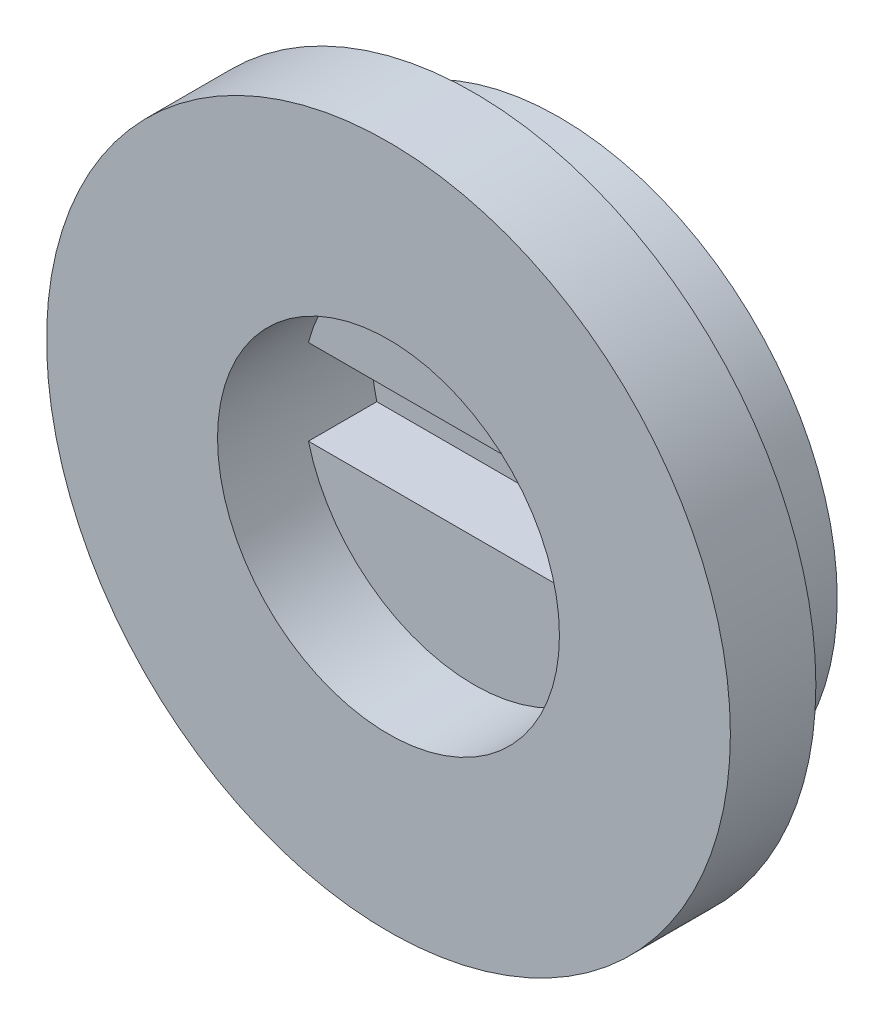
ISO-10303-21;
HEADER;
FILE_DESCRIPTION(('STEP AP214'),'2;1');
FILE_NAME('part.step','',(''),(''),'','','');
FILE_SCHEMA(('AUTOMOTIVE_DESIGN { 1 0 10303 214 1 1 1 1 }'));
ENDSEC;
DATA;
#1=APPLICATION_CONTEXT('core data for automotive mechanical design processes');
#2=APPLICATION_PROTOCOL_DEFINITION('international standard','automotive_design',2000,#1);
#3=PRODUCT_CONTEXT('',#1,'mechanical');
#4=PRODUCT('Part','Part','',(#3));
#5=PRODUCT_RELATED_PRODUCT_CATEGORY('part','',(#4));
#6=PRODUCT_DEFINITION_FORMATION('','',#4);
#7=PRODUCT_DEFINITION_CONTEXT('part definition',#1,'design');
#8=PRODUCT_DEFINITION('design','',#6,#7);
#9=PRODUCT_DEFINITION_SHAPE('','',#8);
#10=(LENGTH_UNIT() NAMED_UNIT(*) SI_UNIT(.MILLI.,.METRE.));
#11=(NAMED_UNIT(*) PLANE_ANGLE_UNIT() SI_UNIT($,.RADIAN.));
#12=(NAMED_UNIT(*) SI_UNIT($,.STERADIAN.) SOLID_ANGLE_UNIT());
#13=UNCERTAINTY_MEASURE_WITH_UNIT(LENGTH_MEASURE(1.E-05),#10,'distance_accuracy_value','');
#14=(GEOMETRIC_REPRESENTATION_CONTEXT(3) GLOBAL_UNCERTAINTY_ASSIGNED_CONTEXT((#13)) GLOBAL_UNIT_ASSIGNED_CONTEXT((#10,
#11,#12)) REPRESENTATION_CONTEXT('',''));
#15=CARTESIAN_POINT('',(0.,0.,0.));
#16=DIRECTION('',(0.,0.,1.));
#17=DIRECTION('',(1.,0.,0.));
#18=AXIS2_PLACEMENT_3D('',#15,#16,#17);
#19=CARTESIAN_POINT('',(-13.,3.92823712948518,0.));
#20=DIRECTION('',(0.,0.,1.));
#21=DIRECTION('',(1.,0.,0.));
#22=AXIS2_PLACEMENT_3D('',#19,#20,#21);
#23=PLANE('',#22);
#24=DIRECTION('',(1.,0.,0.));
#25=VECTOR('',#24,1.);
#26=CARTESIAN_POINT('',(-11.0635083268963,3.42823712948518,0.));
#27=LINE('',#26,#25);
#28=CARTESIAN_POINT('',(-14.9364916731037,3.42823712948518,0.));
#29=VERTEX_POINT('',#28);
#30=CARTESIAN_POINT('',(-11.0635083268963,3.42823712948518,0.));
#31=VERTEX_POINT('',#30);
#32=EDGE_CURVE('E78',#29,#31,#27,.T.);
#33=ORIENTED_EDGE('',*,*,#32,.F.);
#34=CARTESIAN_POINT('',(-13.,3.92823712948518,0.));
#35=DIRECTION('',(0.,0.,1.));
#36=DIRECTION('',(1.,0.,0.));
#37=AXIS2_PLACEMENT_3D('',#34,#35,#36);
#38=CIRCLE('',#37,2.);
#39=EDGE_CURVE('E89',#29,#31,#38,.T.);
#40=ORIENTED_EDGE('',*,*,#39,.T.);
#41=EDGE_LOOP('',(#33,#40));
#42=FACE_BOUND('',#41,.T.);
#43=ADVANCED_FACE('F33',(#42),#23,.T.);
#44=CARTESIAN_POINT('',(-13.,3.92823712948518,-1.));
#45=DIRECTION('',(0.,0.,1.));
#46=DIRECTION('',(1.,0.,0.));
#47=AXIS2_PLACEMENT_3D('',#44,#45,#46);
#48=CYLINDRICAL_SURFACE('',#47,3.25);
#49=CARTESIAN_POINT('',(-13.,3.92823712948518,-1.));
#50=DIRECTION('',(0.,0.,1.));
#51=DIRECTION('',(1.,0.,0.));
#52=AXIS2_PLACEMENT_3D('',#49,#50,#51);
#53=CIRCLE('',#52,3.25);
#54=CARTESIAN_POINT('',(-9.75,3.92823712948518,-1.));
#55=VERTEX_POINT('',#54);
#56=EDGE_CURVE('E11',#55,#55,#53,.T.);
#57=ORIENTED_EDGE('',*,*,#56,.T.);
#58=EDGE_LOOP('',(#57));
#59=FACE_BOUND('',#58,.T.);
#60=CARTESIAN_POINT('',(-13.,3.92823712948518,0.));
#61=DIRECTION('',(0.,0.,1.));
#62=DIRECTION('',(1.,0.,0.));
#63=AXIS2_PLACEMENT_3D('',#60,#61,#62);
#64=CIRCLE('',#63,3.25);
#65=CARTESIAN_POINT('',(-9.75,3.92823712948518,0.));
#66=VERTEX_POINT('',#65);
#67=EDGE_CURVE('E42',#66,#66,#64,.T.);
#68=ORIENTED_EDGE('',*,*,#67,.F.);
#69=EDGE_LOOP('',(#68));
#70=FACE_BOUND('',#69,.T.);
#71=ADVANCED_FACE('F35',(#59,#70),#48,.T.);
#72=CARTESIAN_POINT('',(-13.,3.92823712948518,-1.));
#73=DIRECTION('',(0.,0.,1.));
#74=DIRECTION('',(1.,0.,0.));
#75=AXIS2_PLACEMENT_3D('',#72,#73,#74);
#76=PLANE('',#75);
#77=ORIENTED_EDGE('',*,*,#56,.F.);
#78=EDGE_LOOP('',(#77));
#79=FACE_BOUND('',#78,.T.);
#80=ADVANCED_FACE('F134',(#79),#76,.F.);
#81=CARTESIAN_POINT('',(-13.,3.92823712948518,1.));
#82=DIRECTION('',(0.,0.,-1.));
#83=DIRECTION('',(-1.,0.,0.));
#84=AXIS2_PLACEMENT_3D('',#81,#82,#83);
#85=CYLINDRICAL_SURFACE('',#84,4.);
#86=CARTESIAN_POINT('',(-13.,3.92823712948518,1.));
#87=DIRECTION('',(0.,0.,1.));
#88=DIRECTION('',(1.,0.,0.));
#89=AXIS2_PLACEMENT_3D('',#86,#87,#88);
#90=CIRCLE('',#89,4.);
#91=CARTESIAN_POINT('',(-9.,3.92823712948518,1.));
#92=VERTEX_POINT('',#91);
#93=EDGE_CURVE('E124',#92,#92,#90,.T.);
#94=ORIENTED_EDGE('',*,*,#93,.F.);
#95=EDGE_LOOP('',(#94));
#96=FACE_BOUND('',#95,.T.);
#97=CARTESIAN_POINT('',(-13.,3.92823712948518,0.));
#98=DIRECTION('',(0.,0.,1.));
#99=DIRECTION('',(1.,0.,0.));
#100=AXIS2_PLACEMENT_3D('',#97,#98,#99);
#101=CIRCLE('',#100,4.);
#102=CARTESIAN_POINT('',(-9.,3.92823712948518,0.));
#103=VERTEX_POINT('',#102);
#104=EDGE_CURVE('E100',#103,#103,#101,.T.);
#105=ORIENTED_EDGE('',*,*,#104,.T.);
#106=EDGE_LOOP('',(#105));
#107=FACE_BOUND('',#106,.T.);
#108=ADVANCED_FACE('F140',(#96,#107),#85,.T.);
#109=CARTESIAN_POINT('',(-13.,3.92823712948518,1.));
#110=DIRECTION('',(0.,0.,1.));
#111=DIRECTION('',(1.,0.,0.));
#112=AXIS2_PLACEMENT_3D('',#109,#110,#111);
#113=PLANE('',#112);
#114=CARTESIAN_POINT('',(-13.,3.92823712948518,1.));
#115=DIRECTION('',(0.,0.,1.));
#116=DIRECTION('',(1.,0.,0.));
#117=AXIS2_PLACEMENT_3D('',#114,#115,#116);
#118=CIRCLE('',#117,2.);
#119=CARTESIAN_POINT('',(-11.,3.92823712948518,1.));
#120=VERTEX_POINT('',#119);
#121=EDGE_CURVE('E97',#120,#120,#118,.T.);
#122=ORIENTED_EDGE('',*,*,#121,.F.);
#123=EDGE_LOOP('',(#122));
#124=FACE_BOUND('',#123,.T.);
#125=ORIENTED_EDGE('',*,*,#93,.T.);
#126=EDGE_LOOP('',(#125));
#127=FACE_BOUND('',#126,.T.);
#128=ADVANCED_FACE('F198',(#124,#127),#113,.T.);
#129=CARTESIAN_POINT('',(-13.,3.92823712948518,0.));
#130=DIRECTION('',(0.,0.,1.));
#131=DIRECTION('',(1.,0.,0.));
#132=AXIS2_PLACEMENT_3D('',#129,#130,#131);
#133=PLANE('',#132);
#134=ORIENTED_EDGE('',*,*,#67,.T.);
#135=EDGE_LOOP('',(#134));
#136=FACE_BOUND('',#135,.T.);
#137=ORIENTED_EDGE('',*,*,#104,.F.);
#138=EDGE_LOOP('',(#137));
#139=FACE_BOUND('',#138,.T.);
#140=ADVANCED_FACE('F130',(#136,#139),#133,.F.);
#141=CARTESIAN_POINT('',(-13.,3.92823712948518,0.));
#142=DIRECTION('',(0.,0.,1.));
#143=DIRECTION('',(1.,0.,0.));
#144=AXIS2_PLACEMENT_3D('',#141,#142,#143);
#145=CYLINDRICAL_SURFACE('',#144,2.);
#146=CARTESIAN_POINT('',(-11.0635083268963,4.42823712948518,0.));
#147=VERTEX_POINT('',#146);
#148=CARTESIAN_POINT('',(-14.9364916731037,4.42823712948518,0.));
#149=VERTEX_POINT('',#148);
#150=EDGE_CURVE('E96',#147,#149,#38,.T.);
#151=ORIENTED_EDGE('',*,*,#150,.F.);
#152=DIRECTION('',(0.,0.,1.));
#153=VECTOR('',#152,1.);
#154=CARTESIAN_POINT('',(-11.0635083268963,4.42823712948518,-0.8));
#155=LINE('',#154,#153);
#156=CARTESIAN_POINT('',(-11.0635083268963,4.42823712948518,-0.8));
#157=VERTEX_POINT('',#156);
#158=EDGE_CURVE('E50',#157,#147,#155,.T.);
#159=ORIENTED_EDGE('',*,*,#158,.F.);
#160=CARTESIAN_POINT('',(-13.,3.92823712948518,-0.8));
#161=DIRECTION('',(0.,0.,1.));
#162=DIRECTION('',(1.,0.,0.));
#163=AXIS2_PLACEMENT_3D('',#160,#161,#162);
#164=CIRCLE('',#163,2.);
#165=CARTESIAN_POINT('',(-11.0635083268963,3.42823712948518,-0.8));
#166=VERTEX_POINT('',#165);
#167=EDGE_CURVE('E117',#166,#157,#164,.T.);
#168=ORIENTED_EDGE('',*,*,#167,.F.);
#169=DIRECTION('',(0.,0.,1.));
#170=VECTOR('',#169,1.);
#171=CARTESIAN_POINT('',(-11.0635083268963,3.42823712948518,-0.8));
#172=LINE('',#171,#170);
#173=EDGE_CURVE('E85',#166,#31,#172,.T.);
#174=ORIENTED_EDGE('',*,*,#173,.T.);
#175=ORIENTED_EDGE('',*,*,#39,.F.);
#176=DIRECTION('',(0.,0.,1.));
#177=VECTOR('',#176,1.);
#178=CARTESIAN_POINT('',(-14.9364916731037,3.42823712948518,-0.8));
#179=LINE('',#178,#177);
#180=CARTESIAN_POINT('',(-14.9364916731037,3.42823712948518,-0.8));
#181=VERTEX_POINT('',#180);
#182=EDGE_CURVE('E75',#181,#29,#179,.T.);
#183=ORIENTED_EDGE('',*,*,#182,.F.);
#184=CARTESIAN_POINT('',(-13.,3.92823712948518,-0.8));
#185=DIRECTION('',(0.,0.,1.));
#186=DIRECTION('',(1.,0.,0.));
#187=AXIS2_PLACEMENT_3D('',#184,#185,#186);
#188=CIRCLE('',#187,2.);
#189=CARTESIAN_POINT('',(-14.9364916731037,4.42823712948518,-0.8));
#190=VERTEX_POINT('',#189);
#191=EDGE_CURVE('E109',#190,#181,#188,.T.);
#192=ORIENTED_EDGE('',*,*,#191,.F.);
#193=DIRECTION('',(0.,0.,1.));
#194=VECTOR('',#193,1.);
#195=CARTESIAN_POINT('',(-14.9364916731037,4.42823712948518,-0.8));
#196=LINE('',#195,#194);
#197=EDGE_CURVE('E55',#190,#149,#196,.T.);
#198=ORIENTED_EDGE('',*,*,#197,.T.);
#199=EDGE_LOOP('',(#151,#159,#168,#174,#175,#183,#192,#198));
#200=FACE_BOUND('',#199,.T.);
#201=ORIENTED_EDGE('',*,*,#121,.T.);
#202=EDGE_LOOP('',(#201));
#203=FACE_BOUND('',#202,.T.);
#204=ADVANCED_FACE('F93',(#200,#203),#145,.F.);
#205=DIRECTION('',(-1.,0.,0.));
#206=VECTOR('',#205,1.);
#207=CARTESIAN_POINT('',(-14.9364916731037,4.42823712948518,0.));
#208=LINE('',#207,#206);
#209=EDGE_CURVE('E90',#147,#149,#208,.T.);
#210=ORIENTED_EDGE('',*,*,#209,.F.);
#211=ORIENTED_EDGE('',*,*,#150,.T.);
#212=EDGE_LOOP('',(#210,#211));
#213=FACE_BOUND('',#212,.T.);
#214=ADVANCED_FACE('F143',(#213),#23,.T.);
#215=CARTESIAN_POINT('',(-14.9364916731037,4.42823712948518,-0.8));
#216=DIRECTION('',(0.,1.,0.));
#217=DIRECTION('',(0.,0.,1.));
#218=AXIS2_PLACEMENT_3D('',#215,#216,#217);
#219=PLANE('',#218);
#220=ORIENTED_EDGE('',*,*,#209,.T.);
#221=ORIENTED_EDGE('',*,*,#197,.F.);
#222=DIRECTION('',(-1.,0.,0.));
#223=VECTOR('',#222,1.);
#224=CARTESIAN_POINT('',(-14.9364916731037,4.42823712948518,-0.8));
#225=LINE('',#224,#223);
#226=EDGE_CURVE('E86',#157,#190,#225,.T.);
#227=ORIENTED_EDGE('',*,*,#226,.F.);
#228=ORIENTED_EDGE('',*,*,#158,.T.);
#229=EDGE_LOOP('',(#220,#221,#227,#228));
#230=FACE_BOUND('',#229,.T.);
#231=ADVANCED_FACE('F150',(#230),#219,.F.);
#232=CARTESIAN_POINT('',(-11.0635083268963,3.42823712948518,-0.8));
#233=DIRECTION('',(0.,-1.,0.));
#234=DIRECTION('',(0.,0.,-1.));
#235=AXIS2_PLACEMENT_3D('',#232,#233,#234);
#236=PLANE('',#235);
#237=ORIENTED_EDGE('',*,*,#32,.T.);
#238=ORIENTED_EDGE('',*,*,#173,.F.);
#239=DIRECTION('',(1.,0.,0.));
#240=VECTOR('',#239,1.);
#241=CARTESIAN_POINT('',(-11.0635083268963,3.42823712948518,-0.8));
#242=LINE('',#241,#240);
#243=EDGE_CURVE('E81',#181,#166,#242,.T.);
#244=ORIENTED_EDGE('',*,*,#243,.F.);
#245=ORIENTED_EDGE('',*,*,#182,.T.);
#246=EDGE_LOOP('',(#237,#238,#244,#245));
#247=FACE_BOUND('',#246,.T.);
#248=ADVANCED_FACE('F77',(#247),#236,.F.);
#249=CARTESIAN_POINT('',(-13.,3.92823712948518,-0.8));
#250=DIRECTION('',(0.,0.,1.));
#251=DIRECTION('',(1.,0.,0.));
#252=AXIS2_PLACEMENT_3D('',#249,#250,#251);
#253=PLANE('',#252);
#254=ORIENTED_EDGE('',*,*,#191,.T.);
#255=ORIENTED_EDGE('',*,*,#243,.T.);
#256=ORIENTED_EDGE('',*,*,#167,.T.);
#257=ORIENTED_EDGE('',*,*,#226,.T.);
#258=EDGE_LOOP('',(#254,#255,#256,#257));
#259=FACE_BOUND('',#258,.T.);
#260=ADVANCED_FACE('F164',(#259),#253,.T.);
#261=CLOSED_SHELL('',(#43,#71,#80,#108,#128,#140,#204,#214,#231,#248,#260));
#262=MANIFOLD_SOLID_BREP('B2',#261);
#263=ADVANCED_BREP_SHAPE_REPRESENTATION('',(#18,#262),#14);
#264=SHAPE_DEFINITION_REPRESENTATION(#9,#263);
ENDSEC;
END-ISO-10303-21;
